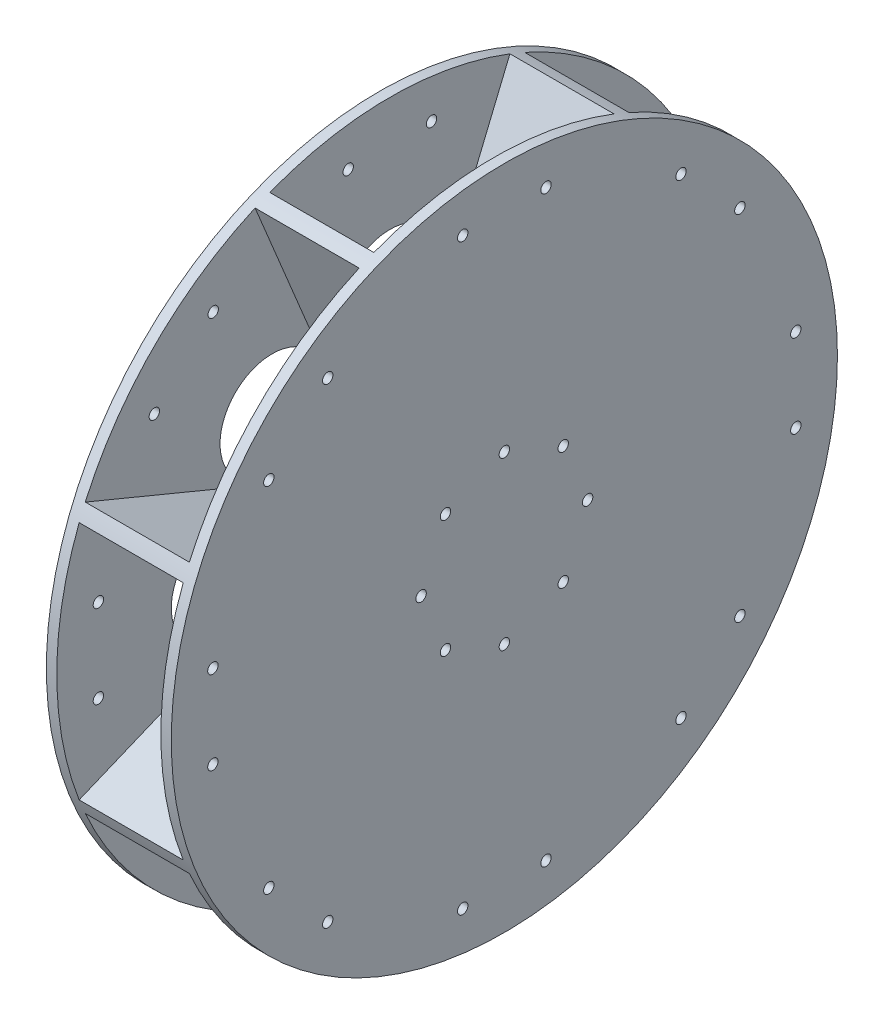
from build123d import *

# Parameters (mm, degrees)
SKETCH1_R           = 203.2
BOSS_EXTRUDE1_DEPTH = 76.2
SKETCH6_R           = 31.75
SKETCH6_R_2         = 3.175
CUT_EXTRUDE1_DEPTH  = 298.299377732
CIRPATTERN1_COUNT   = 8
CUT_EXTRUDE3_DEPTH  = 31.75
CIRPATTERN2_COUNT   = 8
SKETCH11_R          = 31.75
BOSS_EXTRUDE2_DEPTH = 6.35
CIRPATTERN4_COUNT   = 8


with BuildPart() as part:
    # Sketch1 → Boss-Extrude1 (new body)
    with BuildSketch(Plane(origin=(0, 0, 0), x_dir=(0, 0, -1), z_dir=(1, 0, 0))):
        with Locations(Location((0, 0, 0), (0, 0, 180))):
            Circle(SKETCH1_R)
    extrude(amount=BOSS_EXTRUDE1_DEPTH)

    # Sketch6 → Cut-Extrude1 (cut, through all)
    with BuildSketch(Plane(origin=(76.2, 0, 0), x_dir=(0, 0, -1), z_dir=(1, 0, 0))):
        with Locations((0, 101.6)):
            Circle(SKETCH6_R)
        with Locations((25.4, 177.8)):
            Circle(SKETCH6_R_2)
        with Locations((-25.4, 177.8)):
            Circle(SKETCH6_R_2)
        with Locations((0, 50.8)):
            Circle(SKETCH6_R_2)
    cut_extrude1 = extrude(amount=-CUT_EXTRUDE1_DEPTH, mode=Mode.SUBTRACT)

    # CirPattern1: Cut-Extrude1 ×8 about axis
    cirpattern1_axis = Axis((0, 0, 0), (1, 0, 0))
    for i in range(1, CIRPATTERN1_COUNT):
        add(cut_extrude1.rotate(cirpattern1_axis, i * 360 / CIRPATTERN1_COUNT), mode=Mode.SUBTRACT)

    # Sketch8 → Cut-Extrude3 (cut, symmetric)
    with BuildSketch(Plane(origin=(38.1, 0, 0), x_dir=(0, 0, -1), z_dir=(1, 0, 0))):
        with BuildLine():
            Line((12.7, 0), (189.538488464, -73.248900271))
            ThreePointArc((189.538488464, -73.248900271), (203.2, 0), (189.538488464, 73.248900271))
            Line((189.538488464, 73.248900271), (12.7, 0))
        make_face()
    cut_extrude3 = extrude(amount=CUT_EXTRUDE3_DEPTH, both=True, mode=Mode.SUBTRACT)

    # CirPattern2: Cut-Extrude3 ×8 about axis
    cirpattern2_axis = Axis((0, 0, 0), (1, 0, 0))
    for i in range(1, CIRPATTERN2_COUNT):
        add(cut_extrude3.rotate(cirpattern2_axis, i * 360 / CIRPATTERN2_COUNT), mode=Mode.SUBTRACT)

    # Sketch11 → Boss-Extrude2 (add)
    with BuildSketch(Plane(origin=(76.2, 0, 0), x_dir=(0, 0, -1), z_dir=(1, 0, 0))):
        with Locations((0, 101.6)):
            Circle(SKETCH11_R)
    boss_extrude2 = extrude(amount=-BOSS_EXTRUDE2_DEPTH)

    # CirPattern4: Boss-Extrude2 ×8 about axis
    cirpattern4_axis = Axis((76.2, 0, 0), (1, 0, 0))
    for i in range(1, CIRPATTERN4_COUNT):
        add(boss_extrude2.rotate(cirpattern4_axis, i * 360 / CIRPATTERN4_COUNT))


solid = part.part
